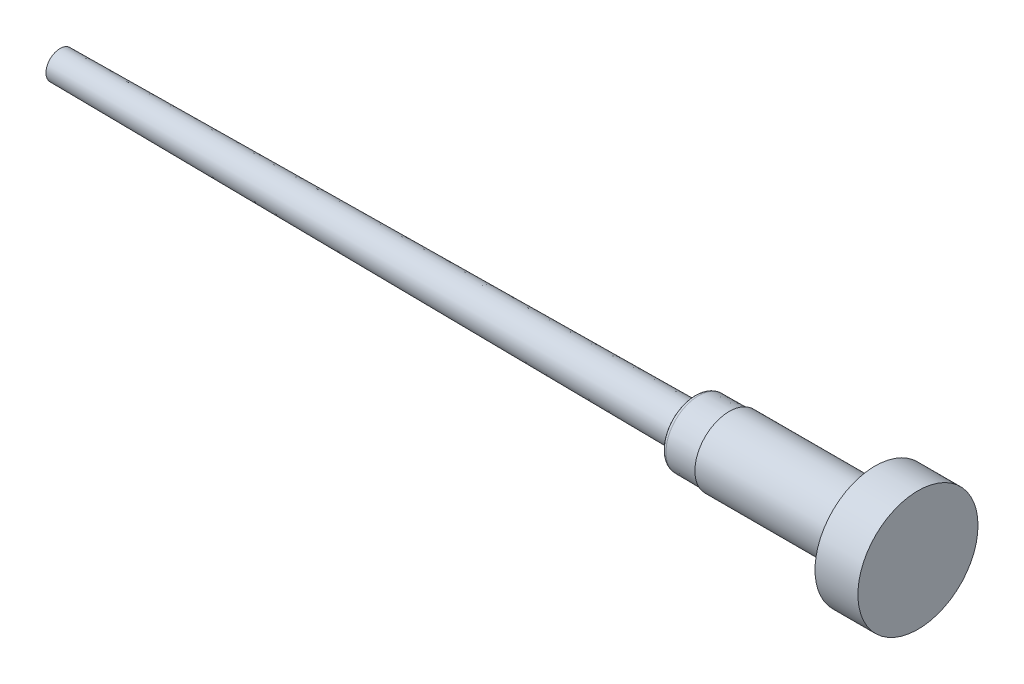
from build123d import *


with BuildPart() as part:
    # Esquisse1 → R_volution1 (revolve)
    with BuildSketch(Plane.XY, mode=Mode.PRIVATE) as r_volution1_sk:
        with BuildLine():
            Line((60.94, 3.310594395), (60.94, 2.77923357))
            ThreePointArc((60.94, 2.77923357), (60.795092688, 2.427226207), (60.444363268, 2.279252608))
            Line((60.444363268, 2.279252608), (-13, 1.63831336))
            Line((-13, 1.63831336), (-13, 0))
            Line((-13, 0), (87, 0))
            Line((87, 0), (87, 7))
            Line((87, 7), (82, 7))
            Line((82, 7), (82, 4.5))
            ThreePointArc((82, 4.5), (81.853553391, 4.146446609), (81.5, 4))
            Line((81.5, 4), (65, 4))
            Line((65, 4), (65, 3.841681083))
            Line((65, 3.841681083), (61.435636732, 3.810575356))
            ThreePointArc((61.435636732, 3.810575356), (61.084907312, 3.662601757), (60.94, 3.310594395))
        make_face()
    revolve(r_volution1_sk.sketch.rotate(Axis((87, 0, 0), (-1, 0, 0)), 90), axis=Axis((87, 0, 0), (-1, 0, 0)))


solid = part.part
